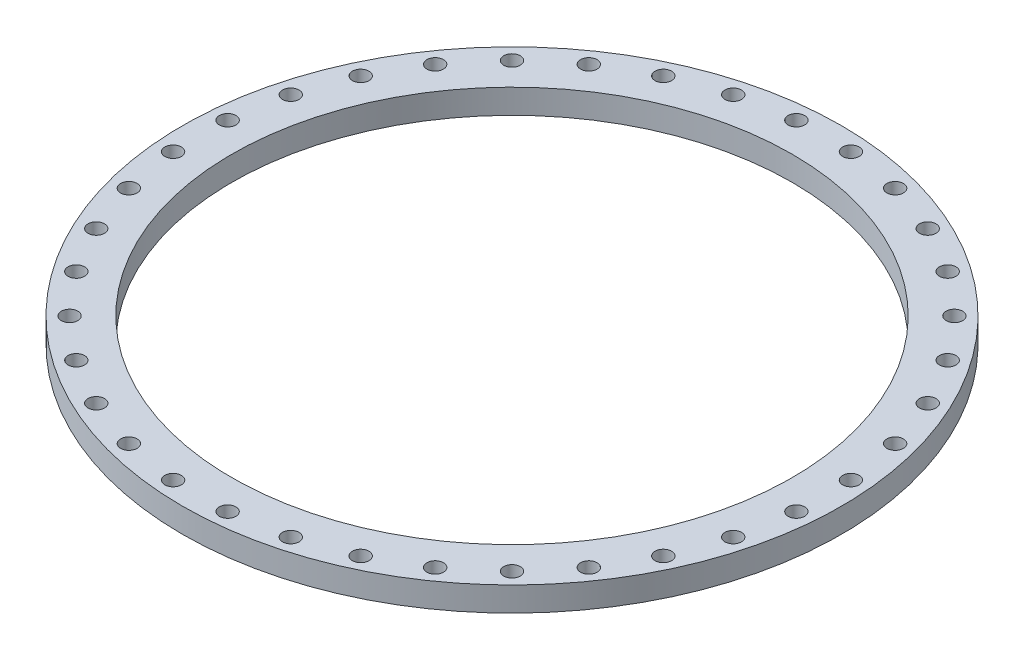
ISO-10303-21;
HEADER;
FILE_DESCRIPTION(('STEP AP214'),'2;1');
FILE_NAME('part.step','',(''),(''),'','','');
FILE_SCHEMA(('AUTOMOTIVE_DESIGN { 1 0 10303 214 1 1 1 1 }'));
ENDSEC;
DATA;
#1=APPLICATION_CONTEXT('core data for automotive mechanical design processes');
#2=APPLICATION_PROTOCOL_DEFINITION('international standard','automotive_design',2000,#1);
#3=PRODUCT_CONTEXT('',#1,'mechanical');
#4=PRODUCT('Part','Part','',(#3));
#5=PRODUCT_RELATED_PRODUCT_CATEGORY('part','',(#4));
#6=PRODUCT_DEFINITION_FORMATION('','',#4);
#7=PRODUCT_DEFINITION_CONTEXT('part definition',#1,'design');
#8=PRODUCT_DEFINITION('design','',#6,#7);
#9=PRODUCT_DEFINITION_SHAPE('','',#8);
#10=(LENGTH_UNIT() NAMED_UNIT(*) SI_UNIT(.MILLI.,.METRE.));
#11=(NAMED_UNIT(*) PLANE_ANGLE_UNIT() SI_UNIT($,.RADIAN.));
#12=(NAMED_UNIT(*) SI_UNIT($,.STERADIAN.) SOLID_ANGLE_UNIT());
#13=UNCERTAINTY_MEASURE_WITH_UNIT(LENGTH_MEASURE(1.E-05),#10,'distance_accuracy_value','');
#14=(GEOMETRIC_REPRESENTATION_CONTEXT(3) GLOBAL_UNCERTAINTY_ASSIGNED_CONTEXT((#13)) GLOBAL_UNIT_ASSIGNED_CONTEXT((#10,
#11,#12)) REPRESENTATION_CONTEXT('',''));
#15=CARTESIAN_POINT('',(0.,0.,0.));
#16=DIRECTION('',(0.,0.,1.));
#17=DIRECTION('',(1.,0.,0.));
#18=AXIS2_PLACEMENT_3D('',#15,#16,#17);
#19=CARTESIAN_POINT('',(0.,0.,0.));
#20=DIRECTION('',(0.,-1.,0.));
#21=DIRECTION('',(0.,0.,-1.));
#22=AXIS2_PLACEMENT_3D('',#19,#20,#21);
#23=CYLINDRICAL_SURFACE('',#22,837.5);
#24=CARTESIAN_POINT('',(0.,0.,0.));
#25=DIRECTION('',(0.,-1.,0.));
#26=DIRECTION('',(0.,0.,-1.));
#27=AXIS2_PLACEMENT_3D('',#24,#25,#26);
#28=CIRCLE('',#27,837.5);
#29=CARTESIAN_POINT('',(0.,0.,-837.5));
#30=VERTEX_POINT('',#29);
#31=EDGE_CURVE('E10',#30,#30,#28,.T.);
#32=ORIENTED_EDGE('',*,*,#31,.F.);
#33=EDGE_LOOP('',(#32));
#34=FACE_BOUND('',#33,.T.);
#35=CARTESIAN_POINT('',(0.,62.,0.));
#36=DIRECTION('',(0.,-1.,0.));
#37=DIRECTION('',(0.,0.,-1.));
#38=AXIS2_PLACEMENT_3D('',#35,#36,#37);
#39=CIRCLE('',#38,837.5);
#40=CARTESIAN_POINT('',(0.,62.,-837.5));
#41=VERTEX_POINT('',#40);
#42=EDGE_CURVE('E48',#41,#41,#39,.T.);
#43=ORIENTED_EDGE('',*,*,#42,.T.);
#44=EDGE_LOOP('',(#43));
#45=FACE_BOUND('',#44,.T.);
#46=ADVANCED_FACE('F34',(#34,#45),#23,.T.);
#47=CARTESIAN_POINT('',(-837.5,0.,0.));
#48=DIRECTION('',(0.,1.,0.));
#49=DIRECTION('',(0.,0.,1.));
#50=AXIS2_PLACEMENT_3D('',#47,#48,#49);
#51=PLANE('',#50);
#52=CARTESIAN_POINT('',(-69.2888154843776,0.,-791.974784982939));
#53=DIRECTION('',(0.,1.,0.));
#54=DIRECTION('',(0.173648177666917,0.,0.984807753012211));
#55=AXIS2_PLACEMENT_3D('',#52,#53,#54);
#56=CIRCLE('',#55,21.);
#57=CARTESIAN_POINT('',(-65.6422037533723,0.,-771.293822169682));
#58=VERTEX_POINT('',#57);
#59=EDGE_CURVE('E172',#58,#58,#56,.T.);
#60=ORIENTED_EDGE('',*,*,#59,.T.);
#61=EDGE_LOOP('',(#60));
#62=FACE_BOUND('',#61,.T.);
#63=CARTESIAN_POINT('',(-205.761140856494,0.,-767.911031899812));
#64=DIRECTION('',(0.,1.,0.));
#65=DIRECTION('',(0.342020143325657,0.,0.939692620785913));
#66=AXIS2_PLACEMENT_3D('',#63,#64,#65);
#67=CIRCLE('',#66,21.);
#68=CARTESIAN_POINT('',(-198.578717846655,0.,-748.177486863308));
#69=VERTEX_POINT('',#68);
#70=EDGE_CURVE('E171',#69,#69,#67,.T.);
#71=ORIENTED_EDGE('',*,*,#70,.T.);
#72=EDGE_LOOP('',(#71));
#73=FACE_BOUND('',#72,.T.);
#74=CARTESIAN_POINT('',(-335.981518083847,0.,-720.514690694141));
#75=DIRECTION('',(0.,1.,0.));
#76=DIRECTION('',(0.499999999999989,0.,0.866025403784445));
#77=AXIS2_PLACEMENT_3D('',#74,#75,#76);
#78=CIRCLE('',#77,21.);
#79=CARTESIAN_POINT('',(-325.481518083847,0.,-702.328157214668));
#80=VERTEX_POINT('',#79);
#81=EDGE_CURVE('E178',#80,#80,#78,.T.);
#82=ORIENTED_EDGE('',*,*,#81,.T.);
#83=EDGE_LOOP('',(#82));
#84=FACE_BOUND('',#83,.T.);
#85=CARTESIAN_POINT('',(-455.993266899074,0.,-651.225875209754));
#86=DIRECTION('',(0.,1.,0.));
#87=DIRECTION('',(0.64278760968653,0.,0.766044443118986));
#88=AXIS2_PLACEMENT_3D('',#85,#86,#87);
#89=CIRCLE('',#88,21.);
#90=CARTESIAN_POINT('',(-442.494727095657,0.,-635.138941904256));
#91=VERTEX_POINT('',#90);
#92=EDGE_CURVE('E184',#91,#91,#89,.T.);
#93=ORIENTED_EDGE('',*,*,#92,.T.);
#94=EDGE_LOOP('',(#93));
#95=FACE_BOUND('',#94,.T.);
#96=CARTESIAN_POINT('',(-562.149891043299,0.,-562.149891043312));
#97=DIRECTION('',(0.,1.,0.));
#98=DIRECTION('',(0.766044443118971,0.,0.642787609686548));
#99=AXIS2_PLACEMENT_3D('',#96,#97,#98);
#100=CIRCLE('',#99,21.);
#101=CARTESIAN_POINT('',(-546.062957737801,0.,-548.651351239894));
#102=VERTEX_POINT('',#101);
#103=EDGE_CURVE('E190',#102,#102,#100,.T.);
#104=ORIENTED_EDGE('',*,*,#103,.T.);
#105=EDGE_LOOP('',(#104));
#106=FACE_BOUND('',#105,.T.);
#107=CARTESIAN_POINT('',(-651.225875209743,0.,-455.993266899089));
#108=DIRECTION('',(0.,1.,0.));
#109=DIRECTION('',(0.866025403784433,0.,0.50000000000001));
#110=AXIS2_PLACEMENT_3D('',#107,#108,#109);
#111=CIRCLE('',#110,21.);
#112=CARTESIAN_POINT('',(-633.03934173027,0.,-445.493266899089));
#113=VERTEX_POINT('',#112);
#114=EDGE_CURVE('E196',#113,#113,#111,.T.);
#115=ORIENTED_EDGE('',*,*,#114,.T.);
#116=EDGE_LOOP('',(#115));
#117=FACE_BOUND('',#116,.T.);
#118=CARTESIAN_POINT('',(-720.514690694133,0.,-335.981518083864));
#119=DIRECTION('',(0.,1.,0.));
#120=DIRECTION('',(0.939692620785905,0.,0.342020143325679));
#121=AXIS2_PLACEMENT_3D('',#118,#119,#120);
#122=CIRCLE('',#121,21.);
#123=CARTESIAN_POINT('',(-700.781145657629,0.,-328.799095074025));
#124=VERTEX_POINT('',#123);
#125=EDGE_CURVE('E202',#124,#124,#122,.T.);
#126=ORIENTED_EDGE('',*,*,#125,.T.);
#127=EDGE_LOOP('',(#126));
#128=FACE_BOUND('',#127,.T.);
#129=CARTESIAN_POINT('',(-767.911031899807,0.,-205.761140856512));
#130=DIRECTION('',(0.,1.,0.));
#131=DIRECTION('',(0.984807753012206,0.,0.17364817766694));
#132=AXIS2_PLACEMENT_3D('',#129,#130,#131);
#133=CIRCLE('',#132,21.);
#134=CARTESIAN_POINT('',(-747.230069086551,0.,-202.114529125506));
#135=VERTEX_POINT('',#134);
#136=EDGE_CURVE('E208',#135,#135,#133,.T.);
#137=ORIENTED_EDGE('',*,*,#136,.T.);
#138=EDGE_LOOP('',(#137));
#139=FACE_BOUND('',#138,.T.);
#140=CARTESIAN_POINT('',(-791.974784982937,0.,-69.2888154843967));
#141=DIRECTION('',(0.,1.,0.));
#142=DIRECTION('',(1.,0.,0.));
#143=AXIS2_PLACEMENT_3D('',#140,#141,#142);
#144=CIRCLE('',#143,21.);
#145=CARTESIAN_POINT('',(-770.974784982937,0.,-69.2888154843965));
#146=VERTEX_POINT('',#145);
#147=EDGE_CURVE('E214',#146,#146,#144,.T.);
#148=ORIENTED_EDGE('',*,*,#147,.T.);
#149=EDGE_LOOP('',(#148));
#150=FACE_BOUND('',#149,.T.);
#151=CARTESIAN_POINT('',(-791.974784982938,0.,69.2888154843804));
#152=DIRECTION('',(0.,1.,0.));
#153=DIRECTION('',(0.98480775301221,0.,-0.173648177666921));
#154=AXIS2_PLACEMENT_3D('',#151,#152,#153);
#155=CIRCLE('',#154,21.);
#156=CARTESIAN_POINT('',(-771.293822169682,0.,65.642203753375));
#157=VERTEX_POINT('',#156);
#158=EDGE_CURVE('E220',#157,#157,#155,.T.);
#159=ORIENTED_EDGE('',*,*,#158,.T.);
#160=EDGE_LOOP('',(#159));
#161=FACE_BOUND('',#160,.T.);
#162=CARTESIAN_POINT('',(-767.911031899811,0.,205.761140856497));
#163=DIRECTION('',(0.,1.,0.));
#164=DIRECTION('',(0.939692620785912,0.,-0.34202014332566));
#165=AXIS2_PLACEMENT_3D('',#162,#163,#164);
#166=CIRCLE('',#165,21.);
#167=CARTESIAN_POINT('',(-748.177486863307,0.,198.578717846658));
#168=VERTEX_POINT('',#167);
#169=EDGE_CURVE('E226',#168,#168,#166,.T.);
#170=ORIENTED_EDGE('',*,*,#169,.T.);
#171=EDGE_LOOP('',(#170));
#172=FACE_BOUND('',#171,.T.);
#173=CARTESIAN_POINT('',(-720.51469069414,0.,335.981518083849));
#174=DIRECTION('',(0.,1.,0.));
#175=DIRECTION('',(0.866025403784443,0.,-0.499999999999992));
#176=AXIS2_PLACEMENT_3D('',#173,#174,#175);
#177=CIRCLE('',#176,21.);
#178=CARTESIAN_POINT('',(-702.328157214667,0.,325.481518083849));
#179=VERTEX_POINT('',#178);
#180=EDGE_CURVE('E232',#179,#179,#177,.T.);
#181=ORIENTED_EDGE('',*,*,#180,.T.);
#182=EDGE_LOOP('',(#181));
#183=FACE_BOUND('',#182,.T.);
#184=CARTESIAN_POINT('',(-651.225875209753,0.,455.993266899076));
#185=DIRECTION('',(0.,1.,0.));
#186=DIRECTION('',(0.766044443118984,0.,-0.642787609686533));
#187=AXIS2_PLACEMENT_3D('',#184,#185,#186);
#188=CIRCLE('',#187,21.);
#189=CARTESIAN_POINT('',(-635.138941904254,0.,442.494727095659));
#190=VERTEX_POINT('',#189);
#191=EDGE_CURVE('E238',#190,#190,#188,.T.);
#192=ORIENTED_EDGE('',*,*,#191,.T.);
#193=EDGE_LOOP('',(#192));
#194=FACE_BOUND('',#193,.T.);
#195=CARTESIAN_POINT('',(-562.14989104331,0.,562.1498910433));
#196=DIRECTION('',(0.,1.,0.));
#197=DIRECTION('',(0.642787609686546,0.,-0.766044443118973));
#198=AXIS2_PLACEMENT_3D('',#195,#196,#197);
#199=CIRCLE('',#198,21.);
#200=CARTESIAN_POINT('',(-548.651351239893,0.,546.062957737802));
#201=VERTEX_POINT('',#200);
#202=EDGE_CURVE('E244',#201,#201,#199,.T.);
#203=ORIENTED_EDGE('',*,*,#202,.T.);
#204=EDGE_LOOP('',(#203));
#205=FACE_BOUND('',#204,.T.);
#206=CARTESIAN_POINT('',(-455.993266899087,0.,651.225875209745));
#207=DIRECTION('',(0.,1.,0.));
#208=DIRECTION('',(0.500000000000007,0.,-0.866025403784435));
#209=AXIS2_PLACEMENT_3D('',#206,#207,#208);
#210=CIRCLE('',#209,21.);
#211=CARTESIAN_POINT('',(-445.493266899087,0.,633.039341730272));
#212=VERTEX_POINT('',#211);
#213=EDGE_CURVE('E250',#212,#212,#210,.T.);
#214=ORIENTED_EDGE('',*,*,#213,.T.);
#215=EDGE_LOOP('',(#214));
#216=FACE_BOUND('',#215,.T.);
#217=CARTESIAN_POINT('',(-335.981518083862,0.,720.514690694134));
#218=DIRECTION('',(0.,1.,0.));
#219=DIRECTION('',(0.342020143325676,0.,-0.939692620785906));
#220=AXIS2_PLACEMENT_3D('',#217,#218,#219);
#221=CIRCLE('',#220,21.);
#222=CARTESIAN_POINT('',(-328.799095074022,0.,700.78114565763));
#223=VERTEX_POINT('',#222);
#224=EDGE_CURVE('E256',#223,#223,#221,.T.);
#225=ORIENTED_EDGE('',*,*,#224,.T.);
#226=EDGE_LOOP('',(#225));
#227=FACE_BOUND('',#226,.T.);
#228=CARTESIAN_POINT('',(-205.76114085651,0.,767.911031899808));
#229=DIRECTION('',(0.,1.,0.));
#230=DIRECTION('',(0.173648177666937,0.,-0.984807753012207));
#231=AXIS2_PLACEMENT_3D('',#228,#229,#230);
#232=CIRCLE('',#231,21.);
#233=CARTESIAN_POINT('',(-202.114529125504,0.,747.230069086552));
#234=VERTEX_POINT('',#233);
#235=EDGE_CURVE('E262',#234,#234,#232,.T.);
#236=ORIENTED_EDGE('',*,*,#235,.T.);
#237=EDGE_LOOP('',(#236));
#238=FACE_BOUND('',#237,.T.);
#239=CARTESIAN_POINT('',(-69.2888154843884,0.,791.974784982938));
#240=DIRECTION('',(0.,1.,0.));
#241=DIRECTION('',(0.,0.,-1.));
#242=AXIS2_PLACEMENT_3D('',#239,#240,#241);
#243=CIRCLE('',#242,21.);
#244=CARTESIAN_POINT('',(-69.2888154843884,0.,770.974784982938));
#245=VERTEX_POINT('',#244);
#246=EDGE_CURVE('E70',#245,#245,#243,.T.);
#247=ORIENTED_EDGE('',*,*,#246,.T.);
#248=EDGE_LOOP('',(#247));
#249=FACE_BOUND('',#248,.T.);
#250=CARTESIAN_POINT('',(69.2888154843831,0.,791.974784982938));
#251=DIRECTION('',(0.,1.,0.));
#252=DIRECTION('',(-0.173648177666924,0.,-0.984807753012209));
#253=AXIS2_PLACEMENT_3D('',#250,#251,#252);
#254=CIRCLE('',#253,21.);
#255=CARTESIAN_POINT('',(65.6422037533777,0.,771.293822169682));
#256=VERTEX_POINT('',#255);
#257=EDGE_CURVE('E69',#256,#256,#254,.T.);
#258=ORIENTED_EDGE('',*,*,#257,.T.);
#259=EDGE_LOOP('',(#258));
#260=FACE_BOUND('',#259,.T.);
#261=CARTESIAN_POINT('',(205.761140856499,0.,767.911031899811));
#262=DIRECTION('',(0.,1.,0.));
#263=DIRECTION('',(-0.342020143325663,0.,-0.939692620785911));
#264=AXIS2_PLACEMENT_3D('',#261,#262,#263);
#265=CIRCLE('',#264,21.);
#266=CARTESIAN_POINT('',(198.57871784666,0.,748.177486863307));
#267=VERTEX_POINT('',#266);
#268=EDGE_CURVE('E77',#267,#267,#265,.T.);
#269=ORIENTED_EDGE('',*,*,#268,.T.);
#270=EDGE_LOOP('',(#269));
#271=FACE_BOUND('',#270,.T.);
#272=CARTESIAN_POINT('',(335.981518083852,0.,720.514690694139));
#273=DIRECTION('',(0.,1.,0.));
#274=DIRECTION('',(-0.499999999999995,0.,-0.866025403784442));
#275=AXIS2_PLACEMENT_3D('',#272,#273,#274);
#276=CIRCLE('',#275,21.);
#277=CARTESIAN_POINT('',(325.481518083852,0.,702.328157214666));
#278=VERTEX_POINT('',#277);
#279=EDGE_CURVE('E83',#278,#278,#276,.T.);
#280=ORIENTED_EDGE('',*,*,#279,.T.);
#281=EDGE_LOOP('',(#280));
#282=FACE_BOUND('',#281,.T.);
#283=CARTESIAN_POINT('',(455.993266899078,0.,651.225875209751));
#284=DIRECTION('',(0.,1.,0.));
#285=DIRECTION('',(-0.642787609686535,0.,-0.766044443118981));
#286=AXIS2_PLACEMENT_3D('',#283,#284,#285);
#287=CIRCLE('',#286,21.);
#288=CARTESIAN_POINT('',(442.494727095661,0.,635.138941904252));
#289=VERTEX_POINT('',#288);
#290=EDGE_CURVE('E89',#289,#289,#287,.T.);
#291=ORIENTED_EDGE('',*,*,#290,.T.);
#292=EDGE_LOOP('',(#291));
#293=FACE_BOUND('',#292,.T.);
#294=CARTESIAN_POINT('',(562.149891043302,0.,562.149891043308));
#295=DIRECTION('',(0.,1.,0.));
#296=DIRECTION('',(-0.766044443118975,0.,-0.642787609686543));
#297=AXIS2_PLACEMENT_3D('',#294,#295,#296);
#298=CIRCLE('',#297,21.);
#299=CARTESIAN_POINT('',(546.062957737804,0.,548.651351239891));
#300=VERTEX_POINT('',#299);
#301=EDGE_CURVE('E95',#300,#300,#298,.T.);
#302=ORIENTED_EDGE('',*,*,#301,.T.);
#303=EDGE_LOOP('',(#302));
#304=FACE_BOUND('',#303,.T.);
#305=CARTESIAN_POINT('',(651.225875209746,0.,455.993266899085));
#306=DIRECTION('',(0.,1.,0.));
#307=DIRECTION('',(-0.866025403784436,0.,-0.500000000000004));
#308=AXIS2_PLACEMENT_3D('',#305,#306,#307);
#309=CIRCLE('',#308,21.);
#310=CARTESIAN_POINT('',(633.039341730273,0.,445.493266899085));
#311=VERTEX_POINT('',#310);
#312=EDGE_CURVE('E101',#311,#311,#309,.T.);
#313=ORIENTED_EDGE('',*,*,#312,.T.);
#314=EDGE_LOOP('',(#313));
#315=FACE_BOUND('',#314,.T.);
#316=CARTESIAN_POINT('',(720.514690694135,0.,335.981518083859));
#317=DIRECTION('',(0.,1.,0.));
#318=DIRECTION('',(-0.939692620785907,0.,-0.342020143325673));
#319=AXIS2_PLACEMENT_3D('',#316,#317,#318);
#320=CIRCLE('',#319,21.);
#321=CARTESIAN_POINT('',(700.781145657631,0.,328.79909507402));
#322=VERTEX_POINT('',#321);
#323=EDGE_CURVE('E107',#322,#322,#320,.T.);
#324=ORIENTED_EDGE('',*,*,#323,.T.);
#325=EDGE_LOOP('',(#324));
#326=FACE_BOUND('',#325,.T.);
#327=CARTESIAN_POINT('',(767.911031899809,0.,205.761140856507));
#328=DIRECTION('',(0.,1.,0.));
#329=DIRECTION('',(-0.984807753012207,0.,-0.173648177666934));
#330=AXIS2_PLACEMENT_3D('',#327,#328,#329);
#331=CIRCLE('',#330,21.);
#332=CARTESIAN_POINT('',(747.230069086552,0.,202.114529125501));
#333=VERTEX_POINT('',#332);
#334=EDGE_CURVE('E113',#333,#333,#331,.T.);
#335=ORIENTED_EDGE('',*,*,#334,.T.);
#336=EDGE_LOOP('',(#335));
#337=FACE_BOUND('',#336,.T.);
#338=CARTESIAN_POINT('',(791.974784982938,0.,69.2888154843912));
#339=DIRECTION('',(0.,1.,0.));
#340=DIRECTION('',(-1.,0.,0.));
#341=AXIS2_PLACEMENT_3D('',#338,#339,#340);
#342=CIRCLE('',#341,21.);
#343=CARTESIAN_POINT('',(770.974784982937,0.,69.2888154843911));
#344=VERTEX_POINT('',#343);
#345=EDGE_CURVE('E119',#344,#344,#342,.T.);
#346=ORIENTED_EDGE('',*,*,#345,.T.);
#347=EDGE_LOOP('',(#346));
#348=FACE_BOUND('',#347,.T.);
#349=CARTESIAN_POINT('',(791.974784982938,0.,-69.2888154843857));
#350=DIRECTION('',(0.,1.,0.));
#351=DIRECTION('',(-0.984807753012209,0.,0.173648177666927));
#352=AXIS2_PLACEMENT_3D('',#349,#350,#351);
#353=CIRCLE('',#352,21.);
#354=CARTESIAN_POINT('',(771.293822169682,0.,-65.6422037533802));
#355=VERTEX_POINT('',#354);
#356=EDGE_CURVE('E125',#355,#355,#353,.T.);
#357=ORIENTED_EDGE('',*,*,#356,.T.);
#358=EDGE_LOOP('',(#357));
#359=FACE_BOUND('',#358,.T.);
#360=CARTESIAN_POINT('',(767.91103189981,0.,-205.761140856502));
#361=DIRECTION('',(0.,1.,0.));
#362=DIRECTION('',(-0.939692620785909,0.,0.342020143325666));
#363=AXIS2_PLACEMENT_3D('',#360,#361,#362);
#364=CIRCLE('',#363,21.);
#365=CARTESIAN_POINT('',(748.177486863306,0.,-198.578717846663));
#366=VERTEX_POINT('',#365);
#367=EDGE_CURVE('E131',#366,#366,#364,.T.);
#368=ORIENTED_EDGE('',*,*,#367,.T.);
#369=EDGE_LOOP('',(#368));
#370=FACE_BOUND('',#369,.T.);
#371=CARTESIAN_POINT('',(720.514690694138,0.,-335.981518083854));
#372=DIRECTION('',(0.,1.,0.));
#373=DIRECTION('',(-0.86602540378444,0.,0.499999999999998));
#374=AXIS2_PLACEMENT_3D('',#371,#372,#373);
#375=CIRCLE('',#374,21.);
#376=CARTESIAN_POINT('',(702.328157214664,0.,-325.481518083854));
#377=VERTEX_POINT('',#376);
#378=EDGE_CURVE('E137',#377,#377,#375,.T.);
#379=ORIENTED_EDGE('',*,*,#378,.T.);
#380=EDGE_LOOP('',(#379));
#381=FACE_BOUND('',#380,.T.);
#382=CARTESIAN_POINT('',(651.225875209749,0.,-455.99326689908));
#383=DIRECTION('',(0.,1.,0.));
#384=DIRECTION('',(-0.766044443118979,0.,0.642787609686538));
#385=AXIS2_PLACEMENT_3D('',#382,#383,#384);
#386=CIRCLE('',#385,21.);
#387=CARTESIAN_POINT('',(635.138941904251,0.,-442.494727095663));
#388=VERTEX_POINT('',#387);
#389=EDGE_CURVE('E143',#388,#388,#386,.T.);
#390=ORIENTED_EDGE('',*,*,#389,.T.);
#391=EDGE_LOOP('',(#390));
#392=FACE_BOUND('',#391,.T.);
#393=CARTESIAN_POINT('',(562.149891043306,0.,-562.149891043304));
#394=DIRECTION('',(0.,1.,0.));
#395=DIRECTION('',(-0.642787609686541,0.,0.766044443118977));
#396=AXIS2_PLACEMENT_3D('',#393,#394,#395);
#397=CIRCLE('',#396,21.);
#398=CARTESIAN_POINT('',(548.651351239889,0.,-546.062957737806));
#399=VERTEX_POINT('',#398);
#400=EDGE_CURVE('E149',#399,#399,#397,.T.);
#401=ORIENTED_EDGE('',*,*,#400,.T.);
#402=EDGE_LOOP('',(#401));
#403=FACE_BOUND('',#402,.T.);
#404=CARTESIAN_POINT('',(455.993266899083,0.,-651.225875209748));
#405=DIRECTION('',(0.,1.,0.));
#406=DIRECTION('',(-0.500000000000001,0.,0.866025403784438));
#407=AXIS2_PLACEMENT_3D('',#404,#405,#406);
#408=CIRCLE('',#407,21.);
#409=CARTESIAN_POINT('',(445.493266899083,0.,-633.039341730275));
#410=VERTEX_POINT('',#409);
#411=EDGE_CURVE('E155',#410,#410,#408,.T.);
#412=ORIENTED_EDGE('',*,*,#411,.T.);
#413=EDGE_LOOP('',(#412));
#414=FACE_BOUND('',#413,.T.);
#415=CARTESIAN_POINT('',(335.981518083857,0.,-720.514690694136));
#416=DIRECTION('',(0.,1.,0.));
#417=DIRECTION('',(-0.342020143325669,0.,0.939692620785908));
#418=AXIS2_PLACEMENT_3D('',#415,#416,#417);
#419=CIRCLE('',#418,21.);
#420=CARTESIAN_POINT('',(328.799095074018,0.,-700.781145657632));
#421=VERTEX_POINT('',#420);
#422=EDGE_CURVE('E161',#421,#421,#419,.T.);
#423=ORIENTED_EDGE('',*,*,#422,.T.);
#424=EDGE_LOOP('',(#423));
#425=FACE_BOUND('',#424,.T.);
#426=CARTESIAN_POINT('',(205.761140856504,0.,-767.911031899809));
#427=DIRECTION('',(0.,1.,0.));
#428=DIRECTION('',(-0.173648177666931,0.,0.984807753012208));
#429=AXIS2_PLACEMENT_3D('',#426,#427,#428);
#430=CIRCLE('',#429,21.);
#431=CARTESIAN_POINT('',(202.114529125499,0.,-747.230069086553));
#432=VERTEX_POINT('',#431);
#433=EDGE_CURVE('E62',#432,#432,#430,.T.);
#434=ORIENTED_EDGE('',*,*,#433,.T.);
#435=EDGE_LOOP('',(#434));
#436=FACE_BOUND('',#435,.T.);
#437=CARTESIAN_POINT('',(69.2888154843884,0.,-791.974784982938));
#438=DIRECTION('',(0.,1.,0.));
#439=DIRECTION('',(0.,0.,1.));
#440=AXIS2_PLACEMENT_3D('',#437,#438,#439);
#441=CIRCLE('',#440,21.);
#442=CARTESIAN_POINT('',(69.2888154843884,0.,-770.974784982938));
#443=VERTEX_POINT('',#442);
#444=EDGE_CURVE('E53',#443,#443,#441,.T.);
#445=ORIENTED_EDGE('',*,*,#444,.T.);
#446=EDGE_LOOP('',(#445));
#447=FACE_BOUND('',#446,.T.);
#448=CARTESIAN_POINT('',(0.,0.,0.));
#449=DIRECTION('',(0.,-1.,0.));
#450=DIRECTION('',(0.,0.,-1.));
#451=AXIS2_PLACEMENT_3D('',#448,#449,#450);
#452=CIRCLE('',#451,712.);
#453=CARTESIAN_POINT('',(0.,0.,-712.));
#454=VERTEX_POINT('',#453);
#455=EDGE_CURVE('E40',#454,#454,#452,.T.);
#456=ORIENTED_EDGE('',*,*,#455,.F.);
#457=EDGE_LOOP('',(#456));
#458=FACE_BOUND('',#457,.T.);
#459=ORIENTED_EDGE('',*,*,#31,.T.);
#460=EDGE_LOOP('',(#459));
#461=FACE_BOUND('',#460,.T.);
#462=ADVANCED_FACE('F270',(#62,#73,#84,#95,#106,#117,#128,#139,#150,#161,#172,#183,#194,#205,
#216,#227,#238,#249,#260,#271,#282,#293,#304,#315,#326,#337,#348,#359,#370,#381,#392,#403,#414,
#425,#436,#447,#458,#461),#51,.F.);
#463=CARTESIAN_POINT('',(0.,0.,0.));
#464=DIRECTION('',(0.,-1.,0.));
#465=DIRECTION('',(0.,0.,-1.));
#466=AXIS2_PLACEMENT_3D('',#463,#464,#465);
#467=CYLINDRICAL_SURFACE('',#466,712.);
#468=CARTESIAN_POINT('',(0.,62.,0.));
#469=DIRECTION('',(0.,-1.,0.));
#470=DIRECTION('',(0.,0.,-1.));
#471=AXIS2_PLACEMENT_3D('',#468,#469,#470);
#472=CIRCLE('',#471,712.);
#473=CARTESIAN_POINT('',(0.,62.,-712.));
#474=VERTEX_POINT('',#473);
#475=EDGE_CURVE('E44',#474,#474,#472,.T.);
#476=ORIENTED_EDGE('',*,*,#475,.F.);
#477=EDGE_LOOP('',(#476));
#478=FACE_BOUND('',#477,.T.);
#479=ORIENTED_EDGE('',*,*,#455,.T.);
#480=EDGE_LOOP('',(#479));
#481=FACE_BOUND('',#480,.T.);
#482=ADVANCED_FACE('F285',(#478,#481),#467,.F.);
#483=CARTESIAN_POINT('',(-837.5,62.,0.));
#484=DIRECTION('',(0.,-1.,0.));
#485=DIRECTION('',(0.,0.,-1.));
#486=AXIS2_PLACEMENT_3D('',#483,#484,#485);
#487=PLANE('',#486);
#488=CARTESIAN_POINT('',(-69.2888154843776,62.,-791.974784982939));
#489=DIRECTION('',(0.,1.,0.));
#490=DIRECTION('',(0.173648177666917,0.,0.984807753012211));
#491=AXIS2_PLACEMENT_3D('',#488,#489,#490);
#492=CIRCLE('',#491,21.);
#493=CARTESIAN_POINT('',(-65.6422037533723,62.,-771.293822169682));
#494=VERTEX_POINT('',#493);
#495=EDGE_CURVE('E168',#494,#494,#492,.T.);
#496=ORIENTED_EDGE('',*,*,#495,.F.);
#497=EDGE_LOOP('',(#496));
#498=FACE_BOUND('',#497,.T.);
#499=CARTESIAN_POINT('',(-205.761140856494,62.,-767.911031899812));
#500=DIRECTION('',(0.,1.,0.));
#501=DIRECTION('',(0.342020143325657,0.,0.939692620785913));
#502=AXIS2_PLACEMENT_3D('',#499,#500,#501);
#503=CIRCLE('',#502,21.);
#504=CARTESIAN_POINT('',(-198.578717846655,62.,-748.177486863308));
#505=VERTEX_POINT('',#504);
#506=EDGE_CURVE('E175',#505,#505,#503,.T.);
#507=ORIENTED_EDGE('',*,*,#506,.F.);
#508=EDGE_LOOP('',(#507));
#509=FACE_BOUND('',#508,.T.);
#510=CARTESIAN_POINT('',(-335.981518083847,62.,-720.514690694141));
#511=DIRECTION('',(0.,1.,0.));
#512=DIRECTION('',(0.499999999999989,0.,0.866025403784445));
#513=AXIS2_PLACEMENT_3D('',#510,#511,#512);
#514=CIRCLE('',#513,21.);
#515=CARTESIAN_POINT('',(-325.481518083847,62.,-702.328157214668));
#516=VERTEX_POINT('',#515);
#517=EDGE_CURVE('E181',#516,#516,#514,.T.);
#518=ORIENTED_EDGE('',*,*,#517,.F.);
#519=EDGE_LOOP('',(#518));
#520=FACE_BOUND('',#519,.T.);
#521=CARTESIAN_POINT('',(-455.993266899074,62.,-651.225875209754));
#522=DIRECTION('',(0.,1.,0.));
#523=DIRECTION('',(0.64278760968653,0.,0.766044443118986));
#524=AXIS2_PLACEMENT_3D('',#521,#522,#523);
#525=CIRCLE('',#524,21.);
#526=CARTESIAN_POINT('',(-442.494727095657,62.,-635.138941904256));
#527=VERTEX_POINT('',#526);
#528=EDGE_CURVE('E187',#527,#527,#525,.T.);
#529=ORIENTED_EDGE('',*,*,#528,.F.);
#530=EDGE_LOOP('',(#529));
#531=FACE_BOUND('',#530,.T.);
#532=CARTESIAN_POINT('',(-562.149891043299,62.,-562.149891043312));
#533=DIRECTION('',(0.,1.,0.));
#534=DIRECTION('',(0.766044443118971,0.,0.642787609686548));
#535=AXIS2_PLACEMENT_3D('',#532,#533,#534);
#536=CIRCLE('',#535,21.);
#537=CARTESIAN_POINT('',(-546.062957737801,62.,-548.651351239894));
#538=VERTEX_POINT('',#537);
#539=EDGE_CURVE('E193',#538,#538,#536,.T.);
#540=ORIENTED_EDGE('',*,*,#539,.F.);
#541=EDGE_LOOP('',(#540));
#542=FACE_BOUND('',#541,.T.);
#543=CARTESIAN_POINT('',(-651.225875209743,62.,-455.993266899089));
#544=DIRECTION('',(0.,1.,0.));
#545=DIRECTION('',(0.866025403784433,0.,0.50000000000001));
#546=AXIS2_PLACEMENT_3D('',#543,#544,#545);
#547=CIRCLE('',#546,21.);
#548=CARTESIAN_POINT('',(-633.03934173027,62.,-445.493266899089));
#549=VERTEX_POINT('',#548);
#550=EDGE_CURVE('E199',#549,#549,#547,.T.);
#551=ORIENTED_EDGE('',*,*,#550,.F.);
#552=EDGE_LOOP('',(#551));
#553=FACE_BOUND('',#552,.T.);
#554=CARTESIAN_POINT('',(-720.514690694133,62.,-335.981518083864));
#555=DIRECTION('',(0.,1.,0.));
#556=DIRECTION('',(0.939692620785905,0.,0.342020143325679));
#557=AXIS2_PLACEMENT_3D('',#554,#555,#556);
#558=CIRCLE('',#557,21.);
#559=CARTESIAN_POINT('',(-700.781145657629,62.,-328.799095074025));
#560=VERTEX_POINT('',#559);
#561=EDGE_CURVE('E205',#560,#560,#558,.T.);
#562=ORIENTED_EDGE('',*,*,#561,.F.);
#563=EDGE_LOOP('',(#562));
#564=FACE_BOUND('',#563,.T.);
#565=CARTESIAN_POINT('',(-767.911031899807,62.,-205.761140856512));
#566=DIRECTION('',(0.,1.,0.));
#567=DIRECTION('',(0.984807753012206,0.,0.17364817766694));
#568=AXIS2_PLACEMENT_3D('',#565,#566,#567);
#569=CIRCLE('',#568,21.);
#570=CARTESIAN_POINT('',(-747.230069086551,62.,-202.114529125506));
#571=VERTEX_POINT('',#570);
#572=EDGE_CURVE('E211',#571,#571,#569,.T.);
#573=ORIENTED_EDGE('',*,*,#572,.F.);
#574=EDGE_LOOP('',(#573));
#575=FACE_BOUND('',#574,.T.);
#576=CARTESIAN_POINT('',(-791.974784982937,62.,-69.2888154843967));
#577=DIRECTION('',(0.,1.,0.));
#578=DIRECTION('',(1.,0.,0.));
#579=AXIS2_PLACEMENT_3D('',#576,#577,#578);
#580=CIRCLE('',#579,21.);
#581=CARTESIAN_POINT('',(-770.974784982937,62.,-69.2888154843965));
#582=VERTEX_POINT('',#581);
#583=EDGE_CURVE('E217',#582,#582,#580,.T.);
#584=ORIENTED_EDGE('',*,*,#583,.F.);
#585=EDGE_LOOP('',(#584));
#586=FACE_BOUND('',#585,.T.);
#587=CARTESIAN_POINT('',(-791.974784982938,62.,69.2888154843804));
#588=DIRECTION('',(0.,1.,0.));
#589=DIRECTION('',(0.98480775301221,0.,-0.173648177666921));
#590=AXIS2_PLACEMENT_3D('',#587,#588,#589);
#591=CIRCLE('',#590,21.);
#592=CARTESIAN_POINT('',(-771.293822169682,62.,65.642203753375));
#593=VERTEX_POINT('',#592);
#594=EDGE_CURVE('E223',#593,#593,#591,.T.);
#595=ORIENTED_EDGE('',*,*,#594,.F.);
#596=EDGE_LOOP('',(#595));
#597=FACE_BOUND('',#596,.T.);
#598=CARTESIAN_POINT('',(-767.911031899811,62.,205.761140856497));
#599=DIRECTION('',(0.,1.,0.));
#600=DIRECTION('',(0.939692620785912,0.,-0.34202014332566));
#601=AXIS2_PLACEMENT_3D('',#598,#599,#600);
#602=CIRCLE('',#601,21.);
#603=CARTESIAN_POINT('',(-748.177486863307,62.,198.578717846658));
#604=VERTEX_POINT('',#603);
#605=EDGE_CURVE('E229',#604,#604,#602,.T.);
#606=ORIENTED_EDGE('',*,*,#605,.F.);
#607=EDGE_LOOP('',(#606));
#608=FACE_BOUND('',#607,.T.);
#609=CARTESIAN_POINT('',(-720.51469069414,62.,335.981518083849));
#610=DIRECTION('',(0.,1.,0.));
#611=DIRECTION('',(0.866025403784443,0.,-0.499999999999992));
#612=AXIS2_PLACEMENT_3D('',#609,#610,#611);
#613=CIRCLE('',#612,21.);
#614=CARTESIAN_POINT('',(-702.328157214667,62.,325.481518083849));
#615=VERTEX_POINT('',#614);
#616=EDGE_CURVE('E235',#615,#615,#613,.T.);
#617=ORIENTED_EDGE('',*,*,#616,.F.);
#618=EDGE_LOOP('',(#617));
#619=FACE_BOUND('',#618,.T.);
#620=CARTESIAN_POINT('',(-651.225875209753,62.,455.993266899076));
#621=DIRECTION('',(0.,1.,0.));
#622=DIRECTION('',(0.766044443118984,0.,-0.642787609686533));
#623=AXIS2_PLACEMENT_3D('',#620,#621,#622);
#624=CIRCLE('',#623,21.);
#625=CARTESIAN_POINT('',(-635.138941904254,62.,442.494727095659));
#626=VERTEX_POINT('',#625);
#627=EDGE_CURVE('E241',#626,#626,#624,.T.);
#628=ORIENTED_EDGE('',*,*,#627,.F.);
#629=EDGE_LOOP('',(#628));
#630=FACE_BOUND('',#629,.T.);
#631=CARTESIAN_POINT('',(-562.14989104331,62.,562.1498910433));
#632=DIRECTION('',(0.,1.,0.));
#633=DIRECTION('',(0.642787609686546,0.,-0.766044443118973));
#634=AXIS2_PLACEMENT_3D('',#631,#632,#633);
#635=CIRCLE('',#634,21.);
#636=CARTESIAN_POINT('',(-548.651351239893,62.,546.062957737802));
#637=VERTEX_POINT('',#636);
#638=EDGE_CURVE('E247',#637,#637,#635,.T.);
#639=ORIENTED_EDGE('',*,*,#638,.F.);
#640=EDGE_LOOP('',(#639));
#641=FACE_BOUND('',#640,.T.);
#642=CARTESIAN_POINT('',(-455.993266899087,62.,651.225875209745));
#643=DIRECTION('',(0.,1.,0.));
#644=DIRECTION('',(0.500000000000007,0.,-0.866025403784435));
#645=AXIS2_PLACEMENT_3D('',#642,#643,#644);
#646=CIRCLE('',#645,21.);
#647=CARTESIAN_POINT('',(-445.493266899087,62.,633.039341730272));
#648=VERTEX_POINT('',#647);
#649=EDGE_CURVE('E253',#648,#648,#646,.T.);
#650=ORIENTED_EDGE('',*,*,#649,.F.);
#651=EDGE_LOOP('',(#650));
#652=FACE_BOUND('',#651,.T.);
#653=CARTESIAN_POINT('',(-335.981518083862,62.,720.514690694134));
#654=DIRECTION('',(0.,1.,0.));
#655=DIRECTION('',(0.342020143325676,0.,-0.939692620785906));
#656=AXIS2_PLACEMENT_3D('',#653,#654,#655);
#657=CIRCLE('',#656,21.);
#658=CARTESIAN_POINT('',(-328.799095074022,62.,700.78114565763));
#659=VERTEX_POINT('',#658);
#660=EDGE_CURVE('E259',#659,#659,#657,.T.);
#661=ORIENTED_EDGE('',*,*,#660,.F.);
#662=EDGE_LOOP('',(#661));
#663=FACE_BOUND('',#662,.T.);
#664=CARTESIAN_POINT('',(-205.76114085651,62.,767.911031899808));
#665=DIRECTION('',(0.,1.,0.));
#666=DIRECTION('',(0.173648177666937,0.,-0.984807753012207));
#667=AXIS2_PLACEMENT_3D('',#664,#665,#666);
#668=CIRCLE('',#667,21.);
#669=CARTESIAN_POINT('',(-202.114529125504,62.,747.230069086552));
#670=VERTEX_POINT('',#669);
#671=EDGE_CURVE('E73',#670,#670,#668,.T.);
#672=ORIENTED_EDGE('',*,*,#671,.F.);
#673=EDGE_LOOP('',(#672));
#674=FACE_BOUND('',#673,.T.);
#675=CARTESIAN_POINT('',(-69.2888154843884,62.,791.974784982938));
#676=DIRECTION('',(0.,1.,0.));
#677=DIRECTION('',(0.,0.,-1.));
#678=AXIS2_PLACEMENT_3D('',#675,#676,#677);
#679=CIRCLE('',#678,21.);
#680=CARTESIAN_POINT('',(-69.2888154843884,62.,770.974784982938));
#681=VERTEX_POINT('',#680);
#682=EDGE_CURVE('E66',#681,#681,#679,.T.);
#683=ORIENTED_EDGE('',*,*,#682,.F.);
#684=EDGE_LOOP('',(#683));
#685=FACE_BOUND('',#684,.T.);
#686=CARTESIAN_POINT('',(69.2888154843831,62.,791.974784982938));
#687=DIRECTION('',(0.,1.,0.));
#688=DIRECTION('',(-0.173648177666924,0.,-0.984807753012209));
#689=AXIS2_PLACEMENT_3D('',#686,#687,#688);
#690=CIRCLE('',#689,21.);
#691=CARTESIAN_POINT('',(65.6422037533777,62.,771.293822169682));
#692=VERTEX_POINT('',#691);
#693=EDGE_CURVE('E74',#692,#692,#690,.T.);
#694=ORIENTED_EDGE('',*,*,#693,.F.);
#695=EDGE_LOOP('',(#694));
#696=FACE_BOUND('',#695,.T.);
#697=CARTESIAN_POINT('',(205.761140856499,62.,767.911031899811));
#698=DIRECTION('',(0.,1.,0.));
#699=DIRECTION('',(-0.342020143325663,0.,-0.939692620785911));
#700=AXIS2_PLACEMENT_3D('',#697,#698,#699);
#701=CIRCLE('',#700,21.);
#702=CARTESIAN_POINT('',(198.57871784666,62.,748.177486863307));
#703=VERTEX_POINT('',#702);
#704=EDGE_CURVE('E80',#703,#703,#701,.T.);
#705=ORIENTED_EDGE('',*,*,#704,.F.);
#706=EDGE_LOOP('',(#705));
#707=FACE_BOUND('',#706,.T.);
#708=CARTESIAN_POINT('',(335.981518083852,62.,720.514690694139));
#709=DIRECTION('',(0.,1.,0.));
#710=DIRECTION('',(-0.499999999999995,0.,-0.866025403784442));
#711=AXIS2_PLACEMENT_3D('',#708,#709,#710);
#712=CIRCLE('',#711,21.);
#713=CARTESIAN_POINT('',(325.481518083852,62.,702.328157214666));
#714=VERTEX_POINT('',#713);
#715=EDGE_CURVE('E86',#714,#714,#712,.T.);
#716=ORIENTED_EDGE('',*,*,#715,.F.);
#717=EDGE_LOOP('',(#716));
#718=FACE_BOUND('',#717,.T.);
#719=CARTESIAN_POINT('',(455.993266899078,62.,651.225875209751));
#720=DIRECTION('',(0.,1.,0.));
#721=DIRECTION('',(-0.642787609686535,0.,-0.766044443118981));
#722=AXIS2_PLACEMENT_3D('',#719,#720,#721);
#723=CIRCLE('',#722,21.);
#724=CARTESIAN_POINT('',(442.494727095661,62.,635.138941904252));
#725=VERTEX_POINT('',#724);
#726=EDGE_CURVE('E92',#725,#725,#723,.T.);
#727=ORIENTED_EDGE('',*,*,#726,.F.);
#728=EDGE_LOOP('',(#727));
#729=FACE_BOUND('',#728,.T.);
#730=CARTESIAN_POINT('',(562.149891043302,62.,562.149891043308));
#731=DIRECTION('',(0.,1.,0.));
#732=DIRECTION('',(-0.766044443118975,0.,-0.642787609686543));
#733=AXIS2_PLACEMENT_3D('',#730,#731,#732);
#734=CIRCLE('',#733,21.);
#735=CARTESIAN_POINT('',(546.062957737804,62.,548.651351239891));
#736=VERTEX_POINT('',#735);
#737=EDGE_CURVE('E98',#736,#736,#734,.T.);
#738=ORIENTED_EDGE('',*,*,#737,.F.);
#739=EDGE_LOOP('',(#738));
#740=FACE_BOUND('',#739,.T.);
#741=CARTESIAN_POINT('',(651.225875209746,62.,455.993266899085));
#742=DIRECTION('',(0.,1.,0.));
#743=DIRECTION('',(-0.866025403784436,0.,-0.500000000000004));
#744=AXIS2_PLACEMENT_3D('',#741,#742,#743);
#745=CIRCLE('',#744,21.);
#746=CARTESIAN_POINT('',(633.039341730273,62.,445.493266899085));
#747=VERTEX_POINT('',#746);
#748=EDGE_CURVE('E104',#747,#747,#745,.T.);
#749=ORIENTED_EDGE('',*,*,#748,.F.);
#750=EDGE_LOOP('',(#749));
#751=FACE_BOUND('',#750,.T.);
#752=CARTESIAN_POINT('',(720.514690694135,62.,335.981518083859));
#753=DIRECTION('',(0.,1.,0.));
#754=DIRECTION('',(-0.939692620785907,0.,-0.342020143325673));
#755=AXIS2_PLACEMENT_3D('',#752,#753,#754);
#756=CIRCLE('',#755,21.);
#757=CARTESIAN_POINT('',(700.781145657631,62.,328.79909507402));
#758=VERTEX_POINT('',#757);
#759=EDGE_CURVE('E110',#758,#758,#756,.T.);
#760=ORIENTED_EDGE('',*,*,#759,.F.);
#761=EDGE_LOOP('',(#760));
#762=FACE_BOUND('',#761,.T.);
#763=CARTESIAN_POINT('',(767.911031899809,62.,205.761140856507));
#764=DIRECTION('',(0.,1.,0.));
#765=DIRECTION('',(-0.984807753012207,0.,-0.173648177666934));
#766=AXIS2_PLACEMENT_3D('',#763,#764,#765);
#767=CIRCLE('',#766,21.);
#768=CARTESIAN_POINT('',(747.230069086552,62.,202.114529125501));
#769=VERTEX_POINT('',#768);
#770=EDGE_CURVE('E116',#769,#769,#767,.T.);
#771=ORIENTED_EDGE('',*,*,#770,.F.);
#772=EDGE_LOOP('',(#771));
#773=FACE_BOUND('',#772,.T.);
#774=CARTESIAN_POINT('',(791.974784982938,62.,69.2888154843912));
#775=DIRECTION('',(0.,1.,0.));
#776=DIRECTION('',(-1.,0.,0.));
#777=AXIS2_PLACEMENT_3D('',#774,#775,#776);
#778=CIRCLE('',#777,21.);
#779=CARTESIAN_POINT('',(770.974784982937,62.,69.2888154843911));
#780=VERTEX_POINT('',#779);
#781=EDGE_CURVE('E122',#780,#780,#778,.T.);
#782=ORIENTED_EDGE('',*,*,#781,.F.);
#783=EDGE_LOOP('',(#782));
#784=FACE_BOUND('',#783,.T.);
#785=CARTESIAN_POINT('',(791.974784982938,62.,-69.2888154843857));
#786=DIRECTION('',(0.,1.,0.));
#787=DIRECTION('',(-0.984807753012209,0.,0.173648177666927));
#788=AXIS2_PLACEMENT_3D('',#785,#786,#787);
#789=CIRCLE('',#788,21.);
#790=CARTESIAN_POINT('',(771.293822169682,62.,-65.6422037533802));
#791=VERTEX_POINT('',#790);
#792=EDGE_CURVE('E128',#791,#791,#789,.T.);
#793=ORIENTED_EDGE('',*,*,#792,.F.);
#794=EDGE_LOOP('',(#793));
#795=FACE_BOUND('',#794,.T.);
#796=CARTESIAN_POINT('',(767.91103189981,62.,-205.761140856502));
#797=DIRECTION('',(0.,1.,0.));
#798=DIRECTION('',(-0.939692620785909,0.,0.342020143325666));
#799=AXIS2_PLACEMENT_3D('',#796,#797,#798);
#800=CIRCLE('',#799,21.);
#801=CARTESIAN_POINT('',(748.177486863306,62.,-198.578717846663));
#802=VERTEX_POINT('',#801);
#803=EDGE_CURVE('E134',#802,#802,#800,.T.);
#804=ORIENTED_EDGE('',*,*,#803,.F.);
#805=EDGE_LOOP('',(#804));
#806=FACE_BOUND('',#805,.T.);
#807=CARTESIAN_POINT('',(720.514690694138,62.,-335.981518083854));
#808=DIRECTION('',(0.,1.,0.));
#809=DIRECTION('',(-0.86602540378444,0.,0.499999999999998));
#810=AXIS2_PLACEMENT_3D('',#807,#808,#809);
#811=CIRCLE('',#810,21.);
#812=CARTESIAN_POINT('',(702.328157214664,62.,-325.481518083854));
#813=VERTEX_POINT('',#812);
#814=EDGE_CURVE('E140',#813,#813,#811,.T.);
#815=ORIENTED_EDGE('',*,*,#814,.F.);
#816=EDGE_LOOP('',(#815));
#817=FACE_BOUND('',#816,.T.);
#818=CARTESIAN_POINT('',(651.225875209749,62.,-455.99326689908));
#819=DIRECTION('',(0.,1.,0.));
#820=DIRECTION('',(-0.766044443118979,0.,0.642787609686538));
#821=AXIS2_PLACEMENT_3D('',#818,#819,#820);
#822=CIRCLE('',#821,21.);
#823=CARTESIAN_POINT('',(635.138941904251,62.,-442.494727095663));
#824=VERTEX_POINT('',#823);
#825=EDGE_CURVE('E146',#824,#824,#822,.T.);
#826=ORIENTED_EDGE('',*,*,#825,.F.);
#827=EDGE_LOOP('',(#826));
#828=FACE_BOUND('',#827,.T.);
#829=CARTESIAN_POINT('',(562.149891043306,62.,-562.149891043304));
#830=DIRECTION('',(0.,1.,0.));
#831=DIRECTION('',(-0.642787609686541,0.,0.766044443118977));
#832=AXIS2_PLACEMENT_3D('',#829,#830,#831);
#833=CIRCLE('',#832,21.);
#834=CARTESIAN_POINT('',(548.651351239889,62.,-546.062957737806));
#835=VERTEX_POINT('',#834);
#836=EDGE_CURVE('E152',#835,#835,#833,.T.);
#837=ORIENTED_EDGE('',*,*,#836,.F.);
#838=EDGE_LOOP('',(#837));
#839=FACE_BOUND('',#838,.T.);
#840=CARTESIAN_POINT('',(455.993266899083,62.,-651.225875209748));
#841=DIRECTION('',(0.,1.,0.));
#842=DIRECTION('',(-0.500000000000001,0.,0.866025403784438));
#843=AXIS2_PLACEMENT_3D('',#840,#841,#842);
#844=CIRCLE('',#843,21.);
#845=CARTESIAN_POINT('',(445.493266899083,62.,-633.039341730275));
#846=VERTEX_POINT('',#845);
#847=EDGE_CURVE('E158',#846,#846,#844,.T.);
#848=ORIENTED_EDGE('',*,*,#847,.F.);
#849=EDGE_LOOP('',(#848));
#850=FACE_BOUND('',#849,.T.);
#851=CARTESIAN_POINT('',(335.981518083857,62.,-720.514690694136));
#852=DIRECTION('',(0.,1.,0.));
#853=DIRECTION('',(-0.342020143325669,0.,0.939692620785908));
#854=AXIS2_PLACEMENT_3D('',#851,#852,#853);
#855=CIRCLE('',#854,21.);
#856=CARTESIAN_POINT('',(328.799095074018,62.,-700.781145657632));
#857=VERTEX_POINT('',#856);
#858=EDGE_CURVE('E65',#857,#857,#855,.T.);
#859=ORIENTED_EDGE('',*,*,#858,.F.);
#860=EDGE_LOOP('',(#859));
#861=FACE_BOUND('',#860,.T.);
#862=CARTESIAN_POINT('',(205.761140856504,62.,-767.911031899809));
#863=DIRECTION('',(0.,1.,0.));
#864=DIRECTION('',(-0.173648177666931,0.,0.984807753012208));
#865=AXIS2_PLACEMENT_3D('',#862,#863,#864);
#866=CIRCLE('',#865,21.);
#867=CARTESIAN_POINT('',(202.114529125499,62.,-747.230069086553));
#868=VERTEX_POINT('',#867);
#869=EDGE_CURVE('E59',#868,#868,#866,.T.);
#870=ORIENTED_EDGE('',*,*,#869,.F.);
#871=EDGE_LOOP('',(#870));
#872=FACE_BOUND('',#871,.T.);
#873=CARTESIAN_POINT('',(69.2888154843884,62.,-791.974784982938));
#874=DIRECTION('',(0.,1.,0.));
#875=DIRECTION('',(0.,0.,1.));
#876=AXIS2_PLACEMENT_3D('',#873,#874,#875);
#877=CIRCLE('',#876,21.);
#878=CARTESIAN_POINT('',(69.2888154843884,62.,-770.974784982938));
#879=VERTEX_POINT('',#878);
#880=EDGE_CURVE('E56',#879,#879,#877,.T.);
#881=ORIENTED_EDGE('',*,*,#880,.F.);
#882=EDGE_LOOP('',(#881));
#883=FACE_BOUND('',#882,.T.);
#884=ORIENTED_EDGE('',*,*,#42,.F.);
#885=EDGE_LOOP('',(#884));
#886=FACE_BOUND('',#885,.T.);
#887=ORIENTED_EDGE('',*,*,#475,.T.);
#888=EDGE_LOOP('',(#887));
#889=FACE_BOUND('',#888,.T.);
#890=ADVANCED_FACE('F281',(#498,#509,#520,#531,#542,#553,#564,#575,#586,#597,#608,#619,#630,
#641,#652,#663,#674,#685,#696,#707,#718,#729,#740,#751,#762,#773,#784,#795,#806,#817,#828,#839,
#850,#861,#872,#883,#886,#889),#487,.F.);
#891=CARTESIAN_POINT('',(69.2888154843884,62.,-791.974784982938));
#892=DIRECTION('',(0.,1.,0.));
#893=DIRECTION('',(0.,0.,1.));
#894=AXIS2_PLACEMENT_3D('',#891,#892,#893);
#895=CYLINDRICAL_SURFACE('',#894,21.);
#896=ORIENTED_EDGE('',*,*,#444,.F.);
#897=EDGE_LOOP('',(#896));
#898=FACE_BOUND('',#897,.T.);
#899=ORIENTED_EDGE('',*,*,#880,.T.);
#900=EDGE_LOOP('',(#899));
#901=FACE_BOUND('',#900,.T.);
#902=ADVANCED_FACE('F284',(#898,#901),#895,.F.);
#903=CARTESIAN_POINT('',(205.761140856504,62.,-767.911031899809));
#904=DIRECTION('',(0.,1.,0.));
#905=DIRECTION('',(-0.173648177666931,0.,0.984807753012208));
#906=AXIS2_PLACEMENT_3D('',#903,#904,#905);
#907=CYLINDRICAL_SURFACE('',#906,21.);
#908=ORIENTED_EDGE('',*,*,#433,.F.);
#909=EDGE_LOOP('',(#908));
#910=FACE_BOUND('',#909,.T.);
#911=ORIENTED_EDGE('',*,*,#869,.T.);
#912=EDGE_LOOP('',(#911));
#913=FACE_BOUND('',#912,.T.);
#914=ADVANCED_FACE('F361',(#910,#913),#907,.F.);
#915=CARTESIAN_POINT('',(335.981518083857,62.,-720.514690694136));
#916=DIRECTION('',(0.,1.,0.));
#917=DIRECTION('',(-0.342020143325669,0.,0.939692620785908));
#918=AXIS2_PLACEMENT_3D('',#915,#916,#917);
#919=CYLINDRICAL_SURFACE('',#918,21.);
#920=ORIENTED_EDGE('',*,*,#422,.F.);
#921=EDGE_LOOP('',(#920));
#922=FACE_BOUND('',#921,.T.);
#923=ORIENTED_EDGE('',*,*,#858,.T.);
#924=EDGE_LOOP('',(#923));
#925=FACE_BOUND('',#924,.T.);
#926=ADVANCED_FACE('F366',(#922,#925),#919,.F.);
#927=CARTESIAN_POINT('',(455.993266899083,62.,-651.225875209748));
#928=DIRECTION('',(0.,1.,0.));
#929=DIRECTION('',(-0.500000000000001,0.,0.866025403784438));
#930=AXIS2_PLACEMENT_3D('',#927,#928,#929);
#931=CYLINDRICAL_SURFACE('',#930,21.);
#932=ORIENTED_EDGE('',*,*,#411,.F.);
#933=EDGE_LOOP('',(#932));
#934=FACE_BOUND('',#933,.T.);
#935=ORIENTED_EDGE('',*,*,#847,.T.);
#936=EDGE_LOOP('',(#935));
#937=FACE_BOUND('',#936,.T.);
#938=ADVANCED_FACE('F376',(#934,#937),#931,.F.);
#939=CARTESIAN_POINT('',(562.149891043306,62.,-562.149891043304));
#940=DIRECTION('',(0.,1.,0.));
#941=DIRECTION('',(-0.642787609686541,0.,0.766044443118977));
#942=AXIS2_PLACEMENT_3D('',#939,#940,#941);
#943=CYLINDRICAL_SURFACE('',#942,21.);
#944=ORIENTED_EDGE('',*,*,#400,.F.);
#945=EDGE_LOOP('',(#944));
#946=FACE_BOUND('',#945,.T.);
#947=ORIENTED_EDGE('',*,*,#836,.T.);
#948=EDGE_LOOP('',(#947));
#949=FACE_BOUND('',#948,.T.);
#950=ADVANCED_FACE('F386',(#946,#949),#943,.F.);
#951=CARTESIAN_POINT('',(651.225875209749,62.,-455.99326689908));
#952=DIRECTION('',(0.,1.,0.));
#953=DIRECTION('',(-0.766044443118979,0.,0.642787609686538));
#954=AXIS2_PLACEMENT_3D('',#951,#952,#953);
#955=CYLINDRICAL_SURFACE('',#954,21.);
#956=ORIENTED_EDGE('',*,*,#389,.F.);
#957=EDGE_LOOP('',(#956));
#958=FACE_BOUND('',#957,.T.);
#959=ORIENTED_EDGE('',*,*,#825,.T.);
#960=EDGE_LOOP('',(#959));
#961=FACE_BOUND('',#960,.T.);
#962=ADVANCED_FACE('F396',(#958,#961),#955,.F.);
#963=CARTESIAN_POINT('',(720.514690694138,62.,-335.981518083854));
#964=DIRECTION('',(0.,1.,0.));
#965=DIRECTION('',(-0.86602540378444,0.,0.499999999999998));
#966=AXIS2_PLACEMENT_3D('',#963,#964,#965);
#967=CYLINDRICAL_SURFACE('',#966,21.);
#968=ORIENTED_EDGE('',*,*,#378,.F.);
#969=EDGE_LOOP('',(#968));
#970=FACE_BOUND('',#969,.T.);
#971=ORIENTED_EDGE('',*,*,#814,.T.);
#972=EDGE_LOOP('',(#971));
#973=FACE_BOUND('',#972,.T.);
#974=ADVANCED_FACE('F406',(#970,#973),#967,.F.);
#975=CARTESIAN_POINT('',(767.91103189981,62.,-205.761140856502));
#976=DIRECTION('',(0.,1.,0.));
#977=DIRECTION('',(-0.939692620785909,0.,0.342020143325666));
#978=AXIS2_PLACEMENT_3D('',#975,#976,#977);
#979=CYLINDRICAL_SURFACE('',#978,21.);
#980=ORIENTED_EDGE('',*,*,#367,.F.);
#981=EDGE_LOOP('',(#980));
#982=FACE_BOUND('',#981,.T.);
#983=ORIENTED_EDGE('',*,*,#803,.T.);
#984=EDGE_LOOP('',(#983));
#985=FACE_BOUND('',#984,.T.);
#986=ADVANCED_FACE('F416',(#982,#985),#979,.F.);
#987=CARTESIAN_POINT('',(791.974784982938,62.,-69.2888154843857));
#988=DIRECTION('',(0.,1.,0.));
#989=DIRECTION('',(-0.984807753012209,0.,0.173648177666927));
#990=AXIS2_PLACEMENT_3D('',#987,#988,#989);
#991=CYLINDRICAL_SURFACE('',#990,21.);
#992=ORIENTED_EDGE('',*,*,#356,.F.);
#993=EDGE_LOOP('',(#992));
#994=FACE_BOUND('',#993,.T.);
#995=ORIENTED_EDGE('',*,*,#792,.T.);
#996=EDGE_LOOP('',(#995));
#997=FACE_BOUND('',#996,.T.);
#998=ADVANCED_FACE('F426',(#994,#997),#991,.F.);
#999=CARTESIAN_POINT('',(791.974784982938,62.,69.2888154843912));
#1000=DIRECTION('',(0.,1.,0.));
#1001=DIRECTION('',(-1.,0.,0.));
#1002=AXIS2_PLACEMENT_3D('',#999,#1000,#1001);
#1003=CYLINDRICAL_SURFACE('',#1002,21.);
#1004=ORIENTED_EDGE('',*,*,#345,.F.);
#1005=EDGE_LOOP('',(#1004));
#1006=FACE_BOUND('',#1005,.T.);
#1007=ORIENTED_EDGE('',*,*,#781,.T.);
#1008=EDGE_LOOP('',(#1007));
#1009=FACE_BOUND('',#1008,.T.);
#1010=ADVANCED_FACE('F436',(#1006,#1009),#1003,.F.);
#1011=CARTESIAN_POINT('',(767.911031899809,62.,205.761140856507));
#1012=DIRECTION('',(0.,1.,0.));
#1013=DIRECTION('',(-0.984807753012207,0.,-0.173648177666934));
#1014=AXIS2_PLACEMENT_3D('',#1011,#1012,#1013);
#1015=CYLINDRICAL_SURFACE('',#1014,21.);
#1016=ORIENTED_EDGE('',*,*,#334,.F.);
#1017=EDGE_LOOP('',(#1016));
#1018=FACE_BOUND('',#1017,.T.);
#1019=ORIENTED_EDGE('',*,*,#770,.T.);
#1020=EDGE_LOOP('',(#1019));
#1021=FACE_BOUND('',#1020,.T.);
#1022=ADVANCED_FACE('F446',(#1018,#1021),#1015,.F.);
#1023=CARTESIAN_POINT('',(720.514690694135,62.,335.981518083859));
#1024=DIRECTION('',(0.,1.,0.));
#1025=DIRECTION('',(-0.939692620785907,0.,-0.342020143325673));
#1026=AXIS2_PLACEMENT_3D('',#1023,#1024,#1025);
#1027=CYLINDRICAL_SURFACE('',#1026,21.);
#1028=ORIENTED_EDGE('',*,*,#323,.F.);
#1029=EDGE_LOOP('',(#1028));
#1030=FACE_BOUND('',#1029,.T.);
#1031=ORIENTED_EDGE('',*,*,#759,.T.);
#1032=EDGE_LOOP('',(#1031));
#1033=FACE_BOUND('',#1032,.T.);
#1034=ADVANCED_FACE('F456',(#1030,#1033),#1027,.F.);
#1035=CARTESIAN_POINT('',(651.225875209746,62.,455.993266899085));
#1036=DIRECTION('',(0.,1.,0.));
#1037=DIRECTION('',(-0.866025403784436,0.,-0.500000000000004));
#1038=AXIS2_PLACEMENT_3D('',#1035,#1036,#1037);
#1039=CYLINDRICAL_SURFACE('',#1038,21.);
#1040=ORIENTED_EDGE('',*,*,#312,.F.);
#1041=EDGE_LOOP('',(#1040));
#1042=FACE_BOUND('',#1041,.T.);
#1043=ORIENTED_EDGE('',*,*,#748,.T.);
#1044=EDGE_LOOP('',(#1043));
#1045=FACE_BOUND('',#1044,.T.);
#1046=ADVANCED_FACE('F466',(#1042,#1045),#1039,.F.);
#1047=CARTESIAN_POINT('',(562.149891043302,62.,562.149891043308));
#1048=DIRECTION('',(0.,1.,0.));
#1049=DIRECTION('',(-0.766044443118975,0.,-0.642787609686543));
#1050=AXIS2_PLACEMENT_3D('',#1047,#1048,#1049);
#1051=CYLINDRICAL_SURFACE('',#1050,21.);
#1052=ORIENTED_EDGE('',*,*,#301,.F.);
#1053=EDGE_LOOP('',(#1052));
#1054=FACE_BOUND('',#1053,.T.);
#1055=ORIENTED_EDGE('',*,*,#737,.T.);
#1056=EDGE_LOOP('',(#1055));
#1057=FACE_BOUND('',#1056,.T.);
#1058=ADVANCED_FACE('F476',(#1054,#1057),#1051,.F.);
#1059=CARTESIAN_POINT('',(455.993266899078,62.,651.225875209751));
#1060=DIRECTION('',(0.,1.,0.));
#1061=DIRECTION('',(-0.642787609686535,0.,-0.766044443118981));
#1062=AXIS2_PLACEMENT_3D('',#1059,#1060,#1061);
#1063=CYLINDRICAL_SURFACE('',#1062,21.);
#1064=ORIENTED_EDGE('',*,*,#290,.F.);
#1065=EDGE_LOOP('',(#1064));
#1066=FACE_BOUND('',#1065,.T.);
#1067=ORIENTED_EDGE('',*,*,#726,.T.);
#1068=EDGE_LOOP('',(#1067));
#1069=FACE_BOUND('',#1068,.T.);
#1070=ADVANCED_FACE('F486',(#1066,#1069),#1063,.F.);
#1071=CARTESIAN_POINT('',(335.981518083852,62.,720.514690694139));
#1072=DIRECTION('',(0.,1.,0.));
#1073=DIRECTION('',(-0.499999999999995,0.,-0.866025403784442));
#1074=AXIS2_PLACEMENT_3D('',#1071,#1072,#1073);
#1075=CYLINDRICAL_SURFACE('',#1074,21.);
#1076=ORIENTED_EDGE('',*,*,#279,.F.);
#1077=EDGE_LOOP('',(#1076));
#1078=FACE_BOUND('',#1077,.T.);
#1079=ORIENTED_EDGE('',*,*,#715,.T.);
#1080=EDGE_LOOP('',(#1079));
#1081=FACE_BOUND('',#1080,.T.);
#1082=ADVANCED_FACE('F496',(#1078,#1081),#1075,.F.);
#1083=CARTESIAN_POINT('',(205.761140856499,62.,767.911031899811));
#1084=DIRECTION('',(0.,1.,0.));
#1085=DIRECTION('',(-0.342020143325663,0.,-0.939692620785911));
#1086=AXIS2_PLACEMENT_3D('',#1083,#1084,#1085);
#1087=CYLINDRICAL_SURFACE('',#1086,21.);
#1088=ORIENTED_EDGE('',*,*,#268,.F.);
#1089=EDGE_LOOP('',(#1088));
#1090=FACE_BOUND('',#1089,.T.);
#1091=ORIENTED_EDGE('',*,*,#704,.T.);
#1092=EDGE_LOOP('',(#1091));
#1093=FACE_BOUND('',#1092,.T.);
#1094=ADVANCED_FACE('F506',(#1090,#1093),#1087,.F.);
#1095=CARTESIAN_POINT('',(69.2888154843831,62.,791.974784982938));
#1096=DIRECTION('',(0.,1.,0.));
#1097=DIRECTION('',(-0.173648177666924,0.,-0.984807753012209));
#1098=AXIS2_PLACEMENT_3D('',#1095,#1096,#1097);
#1099=CYLINDRICAL_SURFACE('',#1098,21.);
#1100=ORIENTED_EDGE('',*,*,#257,.F.);
#1101=EDGE_LOOP('',(#1100));
#1102=FACE_BOUND('',#1101,.T.);
#1103=ORIENTED_EDGE('',*,*,#693,.T.);
#1104=EDGE_LOOP('',(#1103));
#1105=FACE_BOUND('',#1104,.T.);
#1106=ADVANCED_FACE('F516',(#1102,#1105),#1099,.F.);
#1107=CARTESIAN_POINT('',(-69.2888154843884,62.,791.974784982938));
#1108=DIRECTION('',(0.,1.,0.));
#1109=DIRECTION('',(0.,0.,-1.));
#1110=AXIS2_PLACEMENT_3D('',#1107,#1108,#1109);
#1111=CYLINDRICAL_SURFACE('',#1110,21.);
#1112=ORIENTED_EDGE('',*,*,#246,.F.);
#1113=EDGE_LOOP('',(#1112));
#1114=FACE_BOUND('',#1113,.T.);
#1115=ORIENTED_EDGE('',*,*,#682,.T.);
#1116=EDGE_LOOP('',(#1115));
#1117=FACE_BOUND('',#1116,.T.);
#1118=ADVANCED_FACE('F277',(#1114,#1117),#1111,.F.);
#1119=CARTESIAN_POINT('',(-205.76114085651,62.,767.911031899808));
#1120=DIRECTION('',(0.,1.,0.));
#1121=DIRECTION('',(0.173648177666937,0.,-0.984807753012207));
#1122=AXIS2_PLACEMENT_3D('',#1119,#1120,#1121);
#1123=CYLINDRICAL_SURFACE('',#1122,21.);
#1124=ORIENTED_EDGE('',*,*,#235,.F.);
#1125=EDGE_LOOP('',(#1124));
#1126=FACE_BOUND('',#1125,.T.);
#1127=ORIENTED_EDGE('',*,*,#671,.T.);
#1128=EDGE_LOOP('',(#1127));
#1129=FACE_BOUND('',#1128,.T.);
#1130=ADVANCED_FACE('F273',(#1126,#1129),#1123,.F.);
#1131=CARTESIAN_POINT('',(-335.981518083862,62.,720.514690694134));
#1132=DIRECTION('',(0.,1.,0.));
#1133=DIRECTION('',(0.342020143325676,0.,-0.939692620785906));
#1134=AXIS2_PLACEMENT_3D('',#1131,#1132,#1133);
#1135=CYLINDRICAL_SURFACE('',#1134,21.);
#1136=ORIENTED_EDGE('',*,*,#224,.F.);
#1137=EDGE_LOOP('',(#1136));
#1138=FACE_BOUND('',#1137,.T.);
#1139=ORIENTED_EDGE('',*,*,#660,.T.);
#1140=EDGE_LOOP('',(#1139));
#1141=FACE_BOUND('',#1140,.T.);
#1142=ADVANCED_FACE('F276',(#1138,#1141),#1135,.F.);
#1143=CARTESIAN_POINT('',(-455.993266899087,62.,651.225875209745));
#1144=DIRECTION('',(0.,1.,0.));
#1145=DIRECTION('',(0.500000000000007,0.,-0.866025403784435));
#1146=AXIS2_PLACEMENT_3D('',#1143,#1144,#1145);
#1147=CYLINDRICAL_SURFACE('',#1146,21.);
#1148=ORIENTED_EDGE('',*,*,#213,.F.);
#1149=EDGE_LOOP('',(#1148));
#1150=FACE_BOUND('',#1149,.T.);
#1151=ORIENTED_EDGE('',*,*,#649,.T.);
#1152=EDGE_LOOP('',(#1151));
#1153=FACE_BOUND('',#1152,.T.);
#1154=ADVANCED_FACE('F550',(#1150,#1153),#1147,.F.);
#1155=CARTESIAN_POINT('',(-562.14989104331,62.,562.1498910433));
#1156=DIRECTION('',(0.,1.,0.));
#1157=DIRECTION('',(0.642787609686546,0.,-0.766044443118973));
#1158=AXIS2_PLACEMENT_3D('',#1155,#1156,#1157);
#1159=CYLINDRICAL_SURFACE('',#1158,21.);
#1160=ORIENTED_EDGE('',*,*,#202,.F.);
#1161=EDGE_LOOP('',(#1160));
#1162=FACE_BOUND('',#1161,.T.);
#1163=ORIENTED_EDGE('',*,*,#638,.T.);
#1164=EDGE_LOOP('',(#1163));
#1165=FACE_BOUND('',#1164,.T.);
#1166=ADVANCED_FACE('F560',(#1162,#1165),#1159,.F.);
#1167=CARTESIAN_POINT('',(-651.225875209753,62.,455.993266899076));
#1168=DIRECTION('',(0.,1.,0.));
#1169=DIRECTION('',(0.766044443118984,0.,-0.642787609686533));
#1170=AXIS2_PLACEMENT_3D('',#1167,#1168,#1169);
#1171=CYLINDRICAL_SURFACE('',#1170,21.);
#1172=ORIENTED_EDGE('',*,*,#191,.F.);
#1173=EDGE_LOOP('',(#1172));
#1174=FACE_BOUND('',#1173,.T.);
#1175=ORIENTED_EDGE('',*,*,#627,.T.);
#1176=EDGE_LOOP('',(#1175));
#1177=FACE_BOUND('',#1176,.T.);
#1178=ADVANCED_FACE('F570',(#1174,#1177),#1171,.F.);
#1179=CARTESIAN_POINT('',(-720.51469069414,62.,335.981518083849));
#1180=DIRECTION('',(0.,1.,0.));
#1181=DIRECTION('',(0.866025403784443,0.,-0.499999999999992));
#1182=AXIS2_PLACEMENT_3D('',#1179,#1180,#1181);
#1183=CYLINDRICAL_SURFACE('',#1182,21.);
#1184=ORIENTED_EDGE('',*,*,#180,.F.);
#1185=EDGE_LOOP('',(#1184));
#1186=FACE_BOUND('',#1185,.T.);
#1187=ORIENTED_EDGE('',*,*,#616,.T.);
#1188=EDGE_LOOP('',(#1187));
#1189=FACE_BOUND('',#1188,.T.);
#1190=ADVANCED_FACE('F580',(#1186,#1189),#1183,.F.);
#1191=CARTESIAN_POINT('',(-767.911031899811,62.,205.761140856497));
#1192=DIRECTION('',(0.,1.,0.));
#1193=DIRECTION('',(0.939692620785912,0.,-0.34202014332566));
#1194=AXIS2_PLACEMENT_3D('',#1191,#1192,#1193);
#1195=CYLINDRICAL_SURFACE('',#1194,21.);
#1196=ORIENTED_EDGE('',*,*,#169,.F.);
#1197=EDGE_LOOP('',(#1196));
#1198=FACE_BOUND('',#1197,.T.);
#1199=ORIENTED_EDGE('',*,*,#605,.T.);
#1200=EDGE_LOOP('',(#1199));
#1201=FACE_BOUND('',#1200,.T.);
#1202=ADVANCED_FACE('F590',(#1198,#1201),#1195,.F.);
#1203=CARTESIAN_POINT('',(-791.974784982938,62.,69.2888154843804));
#1204=DIRECTION('',(0.,1.,0.));
#1205=DIRECTION('',(0.98480775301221,0.,-0.173648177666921));
#1206=AXIS2_PLACEMENT_3D('',#1203,#1204,#1205);
#1207=CYLINDRICAL_SURFACE('',#1206,21.);
#1208=ORIENTED_EDGE('',*,*,#158,.F.);
#1209=EDGE_LOOP('',(#1208));
#1210=FACE_BOUND('',#1209,.T.);
#1211=ORIENTED_EDGE('',*,*,#594,.T.);
#1212=EDGE_LOOP('',(#1211));
#1213=FACE_BOUND('',#1212,.T.);
#1214=ADVANCED_FACE('F600',(#1210,#1213),#1207,.F.);
#1215=CARTESIAN_POINT('',(-791.974784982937,62.,-69.2888154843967));
#1216=DIRECTION('',(0.,1.,0.));
#1217=DIRECTION('',(1.,0.,0.));
#1218=AXIS2_PLACEMENT_3D('',#1215,#1216,#1217);
#1219=CYLINDRICAL_SURFACE('',#1218,21.);
#1220=ORIENTED_EDGE('',*,*,#147,.F.);
#1221=EDGE_LOOP('',(#1220));
#1222=FACE_BOUND('',#1221,.T.);
#1223=ORIENTED_EDGE('',*,*,#583,.T.);
#1224=EDGE_LOOP('',(#1223));
#1225=FACE_BOUND('',#1224,.T.);
#1226=ADVANCED_FACE('F610',(#1222,#1225),#1219,.F.);
#1227=CARTESIAN_POINT('',(-767.911031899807,62.,-205.761140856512));
#1228=DIRECTION('',(0.,1.,0.));
#1229=DIRECTION('',(0.984807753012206,0.,0.17364817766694));
#1230=AXIS2_PLACEMENT_3D('',#1227,#1228,#1229);
#1231=CYLINDRICAL_SURFACE('',#1230,21.);
#1232=ORIENTED_EDGE('',*,*,#136,.F.);
#1233=EDGE_LOOP('',(#1232));
#1234=FACE_BOUND('',#1233,.T.);
#1235=ORIENTED_EDGE('',*,*,#572,.T.);
#1236=EDGE_LOOP('',(#1235));
#1237=FACE_BOUND('',#1236,.T.);
#1238=ADVANCED_FACE('F620',(#1234,#1237),#1231,.F.);
#1239=CARTESIAN_POINT('',(-720.514690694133,62.,-335.981518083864));
#1240=DIRECTION('',(0.,1.,0.));
#1241=DIRECTION('',(0.939692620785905,0.,0.342020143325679));
#1242=AXIS2_PLACEMENT_3D('',#1239,#1240,#1241);
#1243=CYLINDRICAL_SURFACE('',#1242,21.);
#1244=ORIENTED_EDGE('',*,*,#125,.F.);
#1245=EDGE_LOOP('',(#1244));
#1246=FACE_BOUND('',#1245,.T.);
#1247=ORIENTED_EDGE('',*,*,#561,.T.);
#1248=EDGE_LOOP('',(#1247));
#1249=FACE_BOUND('',#1248,.T.);
#1250=ADVANCED_FACE('F630',(#1246,#1249),#1243,.F.);
#1251=CARTESIAN_POINT('',(-651.225875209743,62.,-455.993266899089));
#1252=DIRECTION('',(0.,1.,0.));
#1253=DIRECTION('',(0.866025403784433,0.,0.50000000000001));
#1254=AXIS2_PLACEMENT_3D('',#1251,#1252,#1253);
#1255=CYLINDRICAL_SURFACE('',#1254,21.);
#1256=ORIENTED_EDGE('',*,*,#114,.F.);
#1257=EDGE_LOOP('',(#1256));
#1258=FACE_BOUND('',#1257,.T.);
#1259=ORIENTED_EDGE('',*,*,#550,.T.);
#1260=EDGE_LOOP('',(#1259));
#1261=FACE_BOUND('',#1260,.T.);
#1262=ADVANCED_FACE('F640',(#1258,#1261),#1255,.F.);
#1263=CARTESIAN_POINT('',(-562.149891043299,62.,-562.149891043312));
#1264=DIRECTION('',(0.,1.,0.));
#1265=DIRECTION('',(0.766044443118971,0.,0.642787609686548));
#1266=AXIS2_PLACEMENT_3D('',#1263,#1264,#1265);
#1267=CYLINDRICAL_SURFACE('',#1266,21.);
#1268=ORIENTED_EDGE('',*,*,#103,.F.);
#1269=EDGE_LOOP('',(#1268));
#1270=FACE_BOUND('',#1269,.T.);
#1271=ORIENTED_EDGE('',*,*,#539,.T.);
#1272=EDGE_LOOP('',(#1271));
#1273=FACE_BOUND('',#1272,.T.);
#1274=ADVANCED_FACE('F650',(#1270,#1273),#1267,.F.);
#1275=CARTESIAN_POINT('',(-455.993266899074,62.,-651.225875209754));
#1276=DIRECTION('',(0.,1.,0.));
#1277=DIRECTION('',(0.64278760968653,0.,0.766044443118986));
#1278=AXIS2_PLACEMENT_3D('',#1275,#1276,#1277);
#1279=CYLINDRICAL_SURFACE('',#1278,21.);
#1280=ORIENTED_EDGE('',*,*,#92,.F.);
#1281=EDGE_LOOP('',(#1280));
#1282=FACE_BOUND('',#1281,.T.);
#1283=ORIENTED_EDGE('',*,*,#528,.T.);
#1284=EDGE_LOOP('',(#1283));
#1285=FACE_BOUND('',#1284,.T.);
#1286=ADVANCED_FACE('F660',(#1282,#1285),#1279,.F.);
#1287=CARTESIAN_POINT('',(-335.981518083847,62.,-720.514690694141));
#1288=DIRECTION('',(0.,1.,0.));
#1289=DIRECTION('',(0.499999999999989,0.,0.866025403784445));
#1290=AXIS2_PLACEMENT_3D('',#1287,#1288,#1289);
#1291=CYLINDRICAL_SURFACE('',#1290,21.);
#1292=ORIENTED_EDGE('',*,*,#81,.F.);
#1293=EDGE_LOOP('',(#1292));
#1294=FACE_BOUND('',#1293,.T.);
#1295=ORIENTED_EDGE('',*,*,#517,.T.);
#1296=EDGE_LOOP('',(#1295));
#1297=FACE_BOUND('',#1296,.T.);
#1298=ADVANCED_FACE('F670',(#1294,#1297),#1291,.F.);
#1299=CARTESIAN_POINT('',(-205.761140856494,62.,-767.911031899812));
#1300=DIRECTION('',(0.,1.,0.));
#1301=DIRECTION('',(0.342020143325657,0.,0.939692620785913));
#1302=AXIS2_PLACEMENT_3D('',#1299,#1300,#1301);
#1303=CYLINDRICAL_SURFACE('',#1302,21.);
#1304=ORIENTED_EDGE('',*,*,#70,.F.);
#1305=EDGE_LOOP('',(#1304));
#1306=FACE_BOUND('',#1305,.T.);
#1307=ORIENTED_EDGE('',*,*,#506,.T.);
#1308=EDGE_LOOP('',(#1307));
#1309=FACE_BOUND('',#1308,.T.);
#1310=ADVANCED_FACE('F680',(#1306,#1309),#1303,.F.);
#1311=CARTESIAN_POINT('',(-69.2888154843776,62.,-791.974784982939));
#1312=DIRECTION('',(0.,1.,0.));
#1313=DIRECTION('',(0.173648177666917,0.,0.984807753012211));
#1314=AXIS2_PLACEMENT_3D('',#1311,#1312,#1313);
#1315=CYLINDRICAL_SURFACE('',#1314,21.);
#1316=ORIENTED_EDGE('',*,*,#59,.F.);
#1317=EDGE_LOOP('',(#1316));
#1318=FACE_BOUND('',#1317,.T.);
#1319=ORIENTED_EDGE('',*,*,#495,.T.);
#1320=EDGE_LOOP('',(#1319));
#1321=FACE_BOUND('',#1320,.T.);
#1322=ADVANCED_FACE('F690',(#1318,#1321),#1315,.F.);
#1323=CLOSED_SHELL('',(#46,#462,#482,#890,#902,#914,#926,#938,#950,#962,#974,#986,#998,#1010,
#1022,#1034,#1046,#1058,#1070,#1082,#1094,#1106,#1118,#1130,#1142,#1154,#1166,#1178,#1190,#1202,
#1214,#1226,#1238,#1250,#1262,#1274,#1286,#1298,#1310,#1322));
#1324=MANIFOLD_SOLID_BREP('B2',#1323);
#1325=ADVANCED_BREP_SHAPE_REPRESENTATION('',(#18,#1324),#14);
#1326=SHAPE_DEFINITION_REPRESENTATION(#9,#1325);
ENDSEC;
END-ISO-10303-21;
